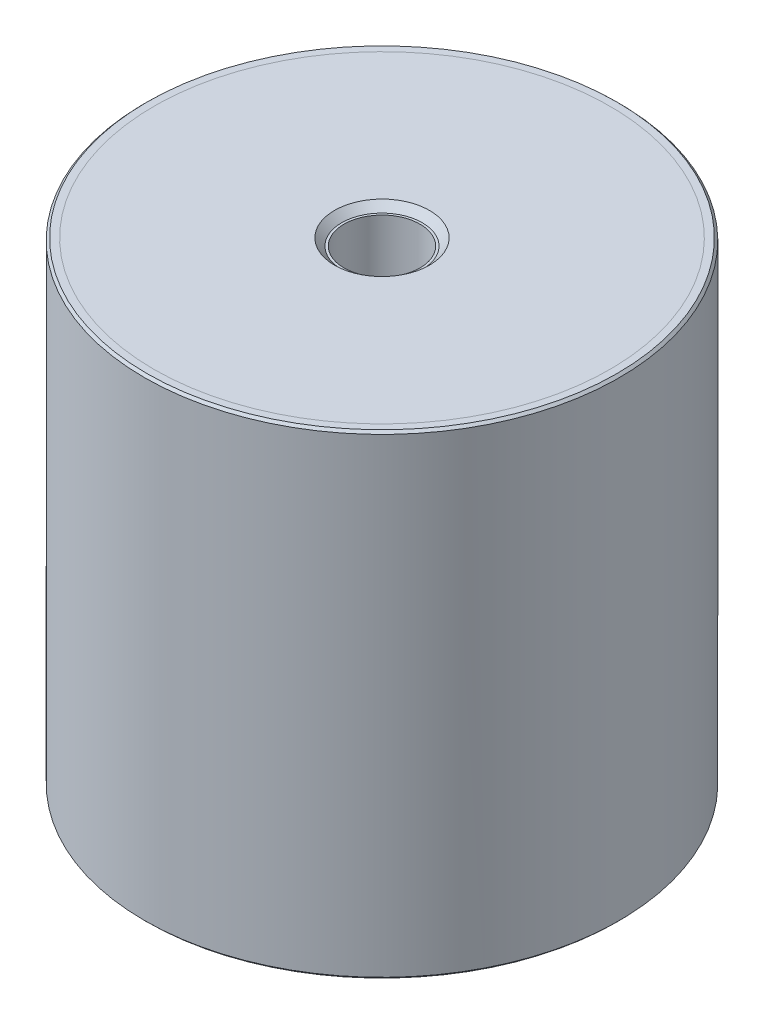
ISO-10303-21;
HEADER;
FILE_DESCRIPTION(('STEP AP214'),'2;1');
FILE_NAME('part.step','',(''),(''),'','','');
FILE_SCHEMA(('AUTOMOTIVE_DESIGN { 1 0 10303 214 1 1 1 1 }'));
ENDSEC;
DATA;
#1=APPLICATION_CONTEXT('core data for automotive mechanical design processes');
#2=APPLICATION_PROTOCOL_DEFINITION('international standard','automotive_design',2000,#1);
#3=PRODUCT_CONTEXT('',#1,'mechanical');
#4=PRODUCT('Part','Part','',(#3));
#5=PRODUCT_RELATED_PRODUCT_CATEGORY('part','',(#4));
#6=PRODUCT_DEFINITION_FORMATION('','',#4);
#7=PRODUCT_DEFINITION_CONTEXT('part definition',#1,'design');
#8=PRODUCT_DEFINITION('design','',#6,#7);
#9=PRODUCT_DEFINITION_SHAPE('','',#8);
#10=(LENGTH_UNIT() NAMED_UNIT(*) SI_UNIT(.MILLI.,.METRE.));
#11=(NAMED_UNIT(*) PLANE_ANGLE_UNIT() SI_UNIT($,.RADIAN.));
#12=(NAMED_UNIT(*) SI_UNIT($,.STERADIAN.) SOLID_ANGLE_UNIT());
#13=UNCERTAINTY_MEASURE_WITH_UNIT(LENGTH_MEASURE(1.E-05),#10,'distance_accuracy_value','');
#14=(GEOMETRIC_REPRESENTATION_CONTEXT(3) GLOBAL_UNCERTAINTY_ASSIGNED_CONTEXT((#13)) GLOBAL_UNIT_ASSIGNED_CONTEXT((#10,
#11,#12)) REPRESENTATION_CONTEXT('',''));
#15=CARTESIAN_POINT('',(0.,0.,0.));
#16=DIRECTION('',(0.,0.,1.));
#17=DIRECTION('',(1.,0.,0.));
#18=AXIS2_PLACEMENT_3D('',#15,#16,#17);
#19=CARTESIAN_POINT('',(0.,-97.,8.));
#20=DIRECTION('',(0.,1.,0.));
#21=DIRECTION('',(0.,0.,1.));
#22=AXIS2_PLACEMENT_3D('',#19,#20,#21);
#23=PLANE('',#22);
#24=CARTESIAN_POINT('',(0.,-97.,0.));
#25=DIRECTION('',(0.,1.,0.));
#26=DIRECTION('',(0.,0.,1.));
#27=AXIS2_PLACEMENT_3D('',#24,#25,#26);
#28=CIRCLE('',#27,8.50000000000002);
#29=CARTESIAN_POINT('',(0.,-97.,8.50000000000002));
#30=VERTEX_POINT('',#29);
#31=EDGE_CURVE('P0_E10',#30,#30,#28,.F.);
#32=ORIENTED_EDGE('',*,*,#31,.T.);
#33=EDGE_LOOP('',(#32));
#34=FACE_BOUND('',#33,.T.);
#35=CARTESIAN_POINT('',(0.,-97.,0.));
#36=DIRECTION('',(0.,1.,0.));
#37=DIRECTION('',(0.,0.,1.));
#38=AXIS2_PLACEMENT_3D('',#35,#36,#37);
#39=CIRCLE('',#38,48.);
#40=CARTESIAN_POINT('',(0.,-97.,48.));
#41=VERTEX_POINT('',#40);
#42=EDGE_CURVE('P0_E25',#41,#41,#39,.T.);
#43=ORIENTED_EDGE('',*,*,#42,.T.);
#44=EDGE_LOOP('',(#43));
#45=FACE_BOUND('',#44,.T.);
#46=ADVANCED_FACE('P0_F14',(#34,#45),#23,.T.);
#47=CARTESIAN_POINT('',(0.,-28.9659571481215,0.));
#48=DIRECTION('',(0.,1.,0.));
#49=DIRECTION('',(0.,0.,1.));
#50=AXIS2_PLACEMENT_3D('',#47,#48,#49);
#51=CYLINDRICAL_SURFACE('',#50,48.);
#52=CARTESIAN_POINT('',(0.,-98.5,0.));
#53=DIRECTION('',(0.,1.,0.));
#54=DIRECTION('',(0.,0.,1.));
#55=AXIS2_PLACEMENT_3D('',#52,#53,#54);
#56=CIRCLE('',#55,48.);
#57=CARTESIAN_POINT('',(0.,-98.5,48.));
#58=VERTEX_POINT('',#57);
#59=EDGE_CURVE('P0_E29',#58,#58,#56,.T.);
#60=ORIENTED_EDGE('',*,*,#59,.T.);
#61=EDGE_LOOP('',(#60));
#62=FACE_BOUND('',#61,.T.);
#63=ORIENTED_EDGE('',*,*,#42,.F.);
#64=EDGE_LOOP('',(#63));
#65=FACE_BOUND('',#64,.T.);
#66=ADVANCED_FACE('P0_F35',(#62,#65),#51,.T.);
#67=CARTESIAN_POINT('',(0.,-98.5,48.));
#68=DIRECTION('',(0.,-1.,0.));
#69=DIRECTION('',(0.,0.,-1.));
#70=AXIS2_PLACEMENT_3D('',#67,#68,#69);
#71=PLANE('',#70);
#72=CARTESIAN_POINT('',(0.,-98.5,0.));
#73=DIRECTION('',(0.,-1.,0.));
#74=DIRECTION('',(0.,0.,-1.));
#75=AXIS2_PLACEMENT_3D('',#72,#73,#74);
#76=CIRCLE('',#75,10.);
#77=CARTESIAN_POINT('',(0.,-98.5,-10.));
#78=VERTEX_POINT('',#77);
#79=EDGE_CURVE('P0_E21',#78,#78,#76,.F.);
#80=ORIENTED_EDGE('',*,*,#79,.T.);
#81=EDGE_LOOP('',(#80));
#82=FACE_BOUND('',#81,.T.);
#83=ORIENTED_EDGE('',*,*,#59,.F.);
#84=EDGE_LOOP('',(#83));
#85=FACE_BOUND('',#84,.T.);
#86=ADVANCED_FACE('P0_F38',(#82,#85),#71,.T.);
#87=CARTESIAN_POINT('',(0.,-98.5,0.));
#88=DIRECTION('',(0.,-1.,0.));
#89=DIRECTION('',(0.,0.,-1.));
#90=AXIS2_PLACEMENT_3D('',#87,#88,#89);
#91=CONICAL_SURFACE('',#90,10.,0.785398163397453);
#92=ORIENTED_EDGE('',*,*,#31,.F.);
#93=EDGE_LOOP('',(#92));
#94=FACE_BOUND('',#93,.T.);
#95=ORIENTED_EDGE('',*,*,#79,.F.);
#96=EDGE_LOOP('',(#95));
#97=FACE_BOUND('',#96,.T.);
#98=ADVANCED_FACE('P0_F16',(#94,#97),#91,.F.);
#99=CLOSED_SHELL('',(#46,#66,#86,#98));
#100=MANIFOLD_SOLID_BREP('P0_B1',#99);
#101=CARTESIAN_POINT('',(0.,1.5,8.));
#102=DIRECTION('',(0.,1.,0.));
#103=DIRECTION('',(0.,0.,1.));
#104=AXIS2_PLACEMENT_3D('',#101,#102,#103);
#105=PLANE('',#104);
#106=CARTESIAN_POINT('',(0.,1.5,0.));
#107=DIRECTION('',(0.,1.,0.));
#108=DIRECTION('',(0.,0.,1.));
#109=AXIS2_PLACEMENT_3D('',#106,#107,#108);
#110=CIRCLE('',#109,10.);
#111=CARTESIAN_POINT('',(0.,1.5,10.));
#112=VERTEX_POINT('',#111);
#113=EDGE_CURVE('P1_E10',#112,#112,#110,.F.);
#114=ORIENTED_EDGE('',*,*,#113,.T.);
#115=EDGE_LOOP('',(#114));
#116=FACE_BOUND('',#115,.T.);
#117=CARTESIAN_POINT('',(0.,1.5,0.));
#118=DIRECTION('',(0.,1.,0.));
#119=DIRECTION('',(0.,0.,1.));
#120=AXIS2_PLACEMENT_3D('',#117,#118,#119);
#121=CIRCLE('',#120,48.);
#122=CARTESIAN_POINT('',(0.,1.5,48.));
#123=VERTEX_POINT('',#122);
#124=EDGE_CURVE('P1_E25',#123,#123,#121,.T.);
#125=ORIENTED_EDGE('',*,*,#124,.T.);
#126=EDGE_LOOP('',(#125));
#127=FACE_BOUND('',#126,.T.);
#128=ADVANCED_FACE('P1_F14',(#116,#127),#105,.T.);
#129=CARTESIAN_POINT('',(0.,69.5340428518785,0.));
#130=DIRECTION('',(0.,1.,0.));
#131=DIRECTION('',(0.,0.,1.));
#132=AXIS2_PLACEMENT_3D('',#129,#130,#131);
#133=CYLINDRICAL_SURFACE('',#132,48.);
#134=CARTESIAN_POINT('',(0.,0.,0.));
#135=DIRECTION('',(0.,1.,0.));
#136=DIRECTION('',(0.,0.,1.));
#137=AXIS2_PLACEMENT_3D('',#134,#135,#136);
#138=CIRCLE('',#137,48.);
#139=CARTESIAN_POINT('',(0.,0.,48.));
#140=VERTEX_POINT('',#139);
#141=EDGE_CURVE('P1_E29',#140,#140,#138,.T.);
#142=ORIENTED_EDGE('',*,*,#141,.T.);
#143=EDGE_LOOP('',(#142));
#144=FACE_BOUND('',#143,.T.);
#145=ORIENTED_EDGE('',*,*,#124,.F.);
#146=EDGE_LOOP('',(#145));
#147=FACE_BOUND('',#146,.T.);
#148=ADVANCED_FACE('P1_F35',(#144,#147),#133,.T.);
#149=CARTESIAN_POINT('',(0.,0.,48.));
#150=DIRECTION('',(0.,-1.,0.));
#151=DIRECTION('',(0.,0.,-1.));
#152=AXIS2_PLACEMENT_3D('',#149,#150,#151);
#153=PLANE('',#152);
#154=CARTESIAN_POINT('',(0.,0.,0.));
#155=DIRECTION('',(0.,-1.,0.));
#156=DIRECTION('',(0.,0.,-1.));
#157=AXIS2_PLACEMENT_3D('',#154,#155,#156);
#158=CIRCLE('',#157,8.50000000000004);
#159=CARTESIAN_POINT('',(0.,0.,-8.50000000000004));
#160=VERTEX_POINT('',#159);
#161=EDGE_CURVE('P1_E21',#160,#160,#158,.F.);
#162=ORIENTED_EDGE('',*,*,#161,.T.);
#163=EDGE_LOOP('',(#162));
#164=FACE_BOUND('',#163,.T.);
#165=ORIENTED_EDGE('',*,*,#141,.F.);
#166=EDGE_LOOP('',(#165));
#167=FACE_BOUND('',#166,.T.);
#168=ADVANCED_FACE('P1_F38',(#164,#167),#153,.T.);
#169=CARTESIAN_POINT('',(0.,-0.500000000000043,0.));
#170=DIRECTION('',(0.,1.,0.));
#171=DIRECTION('',(0.,0.,1.));
#172=AXIS2_PLACEMENT_3D('',#169,#170,#171);
#173=CONICAL_SURFACE('',#172,8.,0.785398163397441);
#174=ORIENTED_EDGE('',*,*,#113,.F.);
#175=EDGE_LOOP('',(#174));
#176=FACE_BOUND('',#175,.T.);
#177=ORIENTED_EDGE('',*,*,#161,.F.);
#178=EDGE_LOOP('',(#177));
#179=FACE_BOUND('',#178,.T.);
#180=ADVANCED_FACE('P1_F16',(#176,#179),#173,.F.);
#181=CLOSED_SHELL('',(#128,#148,#168,#180));
#182=MANIFOLD_SOLID_BREP('P1_B1',#181);
#183=CARTESIAN_POINT('',(0.,0.,0.));
#184=DIRECTION('',(0.,1.,0.));
#185=DIRECTION('',(0.,0.,1.));
#186=AXIS2_PLACEMENT_3D('',#183,#184,#185);
#187=PLANE('',#186);
#188=CARTESIAN_POINT('',(0.,0.,0.));
#189=DIRECTION('',(0.,1.,0.));
#190=DIRECTION('',(0.,0.,1.));
#191=AXIS2_PLACEMENT_3D('',#188,#189,#190);
#192=CIRCLE('',#191,8.);
#193=CARTESIAN_POINT('',(0.,0.,8.));
#194=VERTEX_POINT('',#193);
#195=EDGE_CURVE('P2_E46',#194,#194,#192,.T.);
#196=ORIENTED_EDGE('',*,*,#195,.F.);
#197=EDGE_LOOP('',(#196));
#198=FACE_BOUND('',#197,.T.);
#199=CARTESIAN_POINT('',(0.,0.,0.));
#200=DIRECTION('',(0.,1.,0.));
#201=DIRECTION('',(0.,0.,1.));
#202=AXIS2_PLACEMENT_3D('',#199,#200,#201);
#203=CIRCLE('',#202,48.);
#204=CARTESIAN_POINT('',(0.,0.,48.));
#205=VERTEX_POINT('',#204);
#206=EDGE_CURVE('P2_E33',#205,#205,#203,.T.);
#207=ORIENTED_EDGE('',*,*,#206,.T.);
#208=EDGE_LOOP('',(#207));
#209=FACE_BOUND('',#208,.T.);
#210=ADVANCED_FACE('P2_F13',(#198,#209),#187,.T.);
#211=CARTESIAN_POINT('',(0.,65.5134936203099,0.));
#212=DIRECTION('',(0.,1.,0.));
#213=DIRECTION('',(0.,0.,1.));
#214=AXIS2_PLACEMENT_3D('',#211,#212,#213);
#215=CYLINDRICAL_SURFACE('',#214,48.);
#216=CARTESIAN_POINT('',(0.,1.49999999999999,0.));
#217=DIRECTION('',(0.,1.,0.));
#218=DIRECTION('',(0.,0.,1.));
#219=AXIS2_PLACEMENT_3D('',#216,#217,#218);
#220=CIRCLE('',#219,48.);
#221=CARTESIAN_POINT('',(0.,1.49999999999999,48.));
#222=VERTEX_POINT('',#221);
#223=EDGE_CURVE('P2_E36',#222,#222,#220,.T.);
#224=ORIENTED_EDGE('',*,*,#223,.T.);
#225=EDGE_LOOP('',(#224));
#226=FACE_BOUND('',#225,.T.);
#227=ORIENTED_EDGE('',*,*,#206,.F.);
#228=EDGE_LOOP('',(#227));
#229=FACE_BOUND('',#228,.T.);
#230=ADVANCED_FACE('P2_F92',(#226,#229),#215,.F.);
#231=CARTESIAN_POINT('',(0.,1.49999999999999,48.));
#232=DIRECTION('',(0.,1.,0.));
#233=DIRECTION('',(0.,0.,1.));
#234=AXIS2_PLACEMENT_3D('',#231,#232,#233);
#235=PLANE('',#234);
#236=CARTESIAN_POINT('',(0.,1.49999999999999,0.));
#237=DIRECTION('',(0.,1.,0.));
#238=DIRECTION('',(0.,0.,1.));
#239=AXIS2_PLACEMENT_3D('',#236,#237,#238);
#240=CIRCLE('',#239,49.5);
#241=CARTESIAN_POINT('',(0.,1.49999999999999,49.5));
#242=VERTEX_POINT('',#241);
#243=EDGE_CURVE('P2_E9',#242,#242,#240,.T.);
#244=ORIENTED_EDGE('',*,*,#243,.T.);
#245=EDGE_LOOP('',(#244));
#246=FACE_BOUND('',#245,.T.);
#247=ORIENTED_EDGE('',*,*,#223,.F.);
#248=EDGE_LOOP('',(#247));
#249=FACE_BOUND('',#248,.T.);
#250=ADVANCED_FACE('P2_F88',(#246,#249),#235,.T.);
#251=CARTESIAN_POINT('',(0.,65.5134936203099,0.));
#252=DIRECTION('',(0.,1.,0.));
#253=DIRECTION('',(0.,0.,1.));
#254=AXIS2_PLACEMENT_3D('',#251,#252,#253);
#255=CYLINDRICAL_SURFACE('',#254,50.);
#256=CARTESIAN_POINT('',(0.,-98.,0.));
#257=DIRECTION('',(0.,-1.,0.));
#258=DIRECTION('',(0.,0.,-1.));
#259=AXIS2_PLACEMENT_3D('',#256,#257,#258);
#260=CIRCLE('',#259,50.);
#261=CARTESIAN_POINT('',(0.,-98.,-50.));
#262=VERTEX_POINT('',#261);
#263=EDGE_CURVE('P2_E24',#262,#262,#260,.F.);
#264=ORIENTED_EDGE('',*,*,#263,.T.);
#265=EDGE_LOOP('',(#264));
#266=FACE_BOUND('',#265,.T.);
#267=CARTESIAN_POINT('',(0.,0.999999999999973,0.));
#268=DIRECTION('',(0.,1.,0.));
#269=DIRECTION('',(0.,0.,1.));
#270=AXIS2_PLACEMENT_3D('',#267,#268,#269);
#271=CIRCLE('',#270,50.);
#272=CARTESIAN_POINT('',(0.,0.999999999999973,50.));
#273=VERTEX_POINT('',#272);
#274=EDGE_CURVE('P2_E28',#273,#273,#271,.F.);
#275=ORIENTED_EDGE('',*,*,#274,.T.);
#276=EDGE_LOOP('',(#275));
#277=FACE_BOUND('',#276,.T.);
#278=ADVANCED_FACE('P2_F82',(#266,#277),#255,.T.);
#279=CARTESIAN_POINT('',(0.,-98.5,50.));
#280=DIRECTION('',(0.,-1.,0.));
#281=DIRECTION('',(0.,0.,-1.));
#282=AXIS2_PLACEMENT_3D('',#279,#280,#281);
#283=PLANE('',#282);
#284=CARTESIAN_POINT('',(0.,-98.5,0.));
#285=DIRECTION('',(0.,-1.,0.));
#286=DIRECTION('',(0.,0.,-1.));
#287=AXIS2_PLACEMENT_3D('',#284,#285,#286);
#288=CIRCLE('',#287,49.5);
#289=CARTESIAN_POINT('',(0.,-98.5,-49.5));
#290=VERTEX_POINT('',#289);
#291=EDGE_CURVE('P2_E20',#290,#290,#288,.T.);
#292=ORIENTED_EDGE('',*,*,#291,.T.);
#293=EDGE_LOOP('',(#292));
#294=FACE_BOUND('',#293,.T.);
#295=CARTESIAN_POINT('',(0.,-98.5,0.));
#296=DIRECTION('',(0.,1.,0.));
#297=DIRECTION('',(0.,0.,1.));
#298=AXIS2_PLACEMENT_3D('',#295,#296,#297);
#299=CIRCLE('',#298,48.);
#300=CARTESIAN_POINT('',(0.,-98.5,48.));
#301=VERTEX_POINT('',#300);
#302=EDGE_CURVE('P2_E39',#301,#301,#299,.T.);
#303=ORIENTED_EDGE('',*,*,#302,.T.);
#304=EDGE_LOOP('',(#303));
#305=FACE_BOUND('',#304,.T.);
#306=ADVANCED_FACE('P2_F77',(#294,#305),#283,.T.);
#307=CARTESIAN_POINT('',(0.,65.5134936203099,0.));
#308=DIRECTION('',(0.,1.,0.));
#309=DIRECTION('',(0.,0.,1.));
#310=AXIS2_PLACEMENT_3D('',#307,#308,#309);
#311=CYLINDRICAL_SURFACE('',#310,48.);
#312=CARTESIAN_POINT('',(0.,-97.,0.));
#313=DIRECTION('',(0.,1.,0.));
#314=DIRECTION('',(0.,0.,1.));
#315=AXIS2_PLACEMENT_3D('',#312,#313,#314);
#316=CIRCLE('',#315,48.);
#317=CARTESIAN_POINT('',(0.,-97.,48.));
#318=VERTEX_POINT('',#317);
#319=EDGE_CURVE('P2_E42',#318,#318,#316,.T.);
#320=ORIENTED_EDGE('',*,*,#319,.T.);
#321=EDGE_LOOP('',(#320));
#322=FACE_BOUND('',#321,.T.);
#323=ORIENTED_EDGE('',*,*,#302,.F.);
#324=EDGE_LOOP('',(#323));
#325=FACE_BOUND('',#324,.T.);
#326=ADVANCED_FACE('P2_F71',(#322,#325),#311,.F.);
#327=CARTESIAN_POINT('',(0.,-97.,48.));
#328=DIRECTION('',(0.,-1.,0.));
#329=DIRECTION('',(0.,0.,-1.));
#330=AXIS2_PLACEMENT_3D('',#327,#328,#329);
#331=PLANE('',#330);
#332=CARTESIAN_POINT('',(0.,-97.,0.));
#333=DIRECTION('',(0.,-1.,0.));
#334=DIRECTION('',(0.,0.,-1.));
#335=AXIS2_PLACEMENT_3D('',#332,#333,#334);
#336=CIRCLE('',#335,8.);
#337=CARTESIAN_POINT('',(0.,-97.,-8.));
#338=VERTEX_POINT('',#337);
#339=EDGE_CURVE('P2_E52',#338,#338,#336,.T.);
#340=ORIENTED_EDGE('',*,*,#339,.F.);
#341=EDGE_LOOP('',(#340));
#342=FACE_BOUND('',#341,.T.);
#343=ORIENTED_EDGE('',*,*,#319,.F.);
#344=EDGE_LOOP('',(#343));
#345=FACE_BOUND('',#344,.T.);
#346=ADVANCED_FACE('P2_F67',(#342,#345),#331,.T.);
#347=CARTESIAN_POINT('',(0.,-98.,0.));
#348=DIRECTION('',(0.,1.,0.));
#349=DIRECTION('',(0.,0.,1.));
#350=AXIS2_PLACEMENT_3D('',#347,#348,#349);
#351=CONICAL_SURFACE('',#350,50.,0.785398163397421);
#352=ORIENTED_EDGE('',*,*,#291,.F.);
#353=EDGE_LOOP('',(#352));
#354=FACE_BOUND('',#353,.T.);
#355=ORIENTED_EDGE('',*,*,#263,.F.);
#356=EDGE_LOOP('',(#355));
#357=FACE_BOUND('',#356,.T.);
#358=ADVANCED_FACE('P2_F70',(#354,#357),#351,.T.);
#359=CARTESIAN_POINT('',(0.,1.49999999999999,0.));
#360=DIRECTION('',(0.,-1.,0.));
#361=DIRECTION('',(0.,0.,-1.));
#362=AXIS2_PLACEMENT_3D('',#359,#360,#361);
#363=CONICAL_SURFACE('',#362,49.5,0.785398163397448);
#364=ORIENTED_EDGE('',*,*,#274,.F.);
#365=EDGE_LOOP('',(#364));
#366=FACE_BOUND('',#365,.T.);
#367=ORIENTED_EDGE('',*,*,#243,.F.);
#368=EDGE_LOOP('',(#367));
#369=FACE_BOUND('',#368,.T.);
#370=ADVANCED_FACE('P2_F15',(#366,#369),#363,.T.);
#371=CARTESIAN_POINT('',(0.,-14.5,0.));
#372=DIRECTION('',(0.,1.,0.));
#373=DIRECTION('',(0.,0.,1.));
#374=AXIS2_PLACEMENT_3D('',#371,#372,#373);
#375=CYLINDRICAL_SURFACE('',#374,8.);
#376=CARTESIAN_POINT('',(0.,-14.5,0.));
#377=DIRECTION('',(0.,1.,0.));
#378=DIRECTION('',(0.,0.,1.));
#379=AXIS2_PLACEMENT_3D('',#376,#377,#378);
#380=CIRCLE('',#379,8.);
#381=CARTESIAN_POINT('',(0.,-14.5,8.));
#382=VERTEX_POINT('',#381);
#383=EDGE_CURVE('P2_E45',#382,#382,#380,.T.);
#384=CARTESIAN_POINT('',(0.,-14.5,8.));
#385=CARTESIAN_POINT('',(0.,-14.3489583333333,8.));
#386=CARTESIAN_POINT('',(0.,-14.1979166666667,8.));
#387=CARTESIAN_POINT('',(0.,-13.8958333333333,8.));
#388=CARTESIAN_POINT('',(0.,-13.7447916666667,8.));
#389=CARTESIAN_POINT('',(0.,-13.4427083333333,8.));
#390=CARTESIAN_POINT('',(0.,-13.2916666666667,8.));
#391=CARTESIAN_POINT('',(0.,-12.9895833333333,8.));
#392=CARTESIAN_POINT('',(0.,-12.8385416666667,8.));
#393=CARTESIAN_POINT('',(0.,-12.5364583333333,8.));
#394=CARTESIAN_POINT('',(0.,-12.3854166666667,8.));
#395=CARTESIAN_POINT('',(0.,-12.0833333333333,8.));
#396=CARTESIAN_POINT('',(0.,-11.9322916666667,8.));
#397=CARTESIAN_POINT('',(0.,-11.6302083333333,8.));
#398=CARTESIAN_POINT('',(0.,-11.4791666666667,8.));
#399=CARTESIAN_POINT('',(0.,-11.1770833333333,8.));
#400=CARTESIAN_POINT('',(0.,-11.0260416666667,8.));
#401=CARTESIAN_POINT('',(0.,-10.7239583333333,8.));
#402=CARTESIAN_POINT('',(0.,-10.5729166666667,8.));
#403=CARTESIAN_POINT('',(0.,-10.2708333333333,8.));
#404=CARTESIAN_POINT('',(0.,-10.1197916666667,8.));
#405=CARTESIAN_POINT('',(0.,-9.81770833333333,8.));
#406=CARTESIAN_POINT('',(0.,-9.66666666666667,8.));
#407=CARTESIAN_POINT('',(0.,-9.36458333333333,8.));
#408=CARTESIAN_POINT('',(0.,-9.21354166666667,8.));
#409=CARTESIAN_POINT('',(0.,-8.91145833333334,8.));
#410=CARTESIAN_POINT('',(0.,-8.76041666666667,8.));
#411=CARTESIAN_POINT('',(0.,-8.45833333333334,8.));
#412=CARTESIAN_POINT('',(0.,-8.30729166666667,8.));
#413=CARTESIAN_POINT('',(0.,-8.00520833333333,8.));
#414=CARTESIAN_POINT('',(0.,-7.85416666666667,8.));
#415=CARTESIAN_POINT('',(0.,-7.55208333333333,8.));
#416=CARTESIAN_POINT('',(0.,-7.40104166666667,8.));
#417=CARTESIAN_POINT('',(0.,-7.09895833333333,8.));
#418=CARTESIAN_POINT('',(0.,-6.94791666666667,8.));
#419=CARTESIAN_POINT('',(0.,-6.64583333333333,8.));
#420=CARTESIAN_POINT('',(0.,-6.49479166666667,8.));
#421=CARTESIAN_POINT('',(0.,-6.19270833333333,8.));
#422=CARTESIAN_POINT('',(0.,-6.04166666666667,8.));
#423=CARTESIAN_POINT('',(0.,-5.73958333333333,8.));
#424=CARTESIAN_POINT('',(0.,-5.58854166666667,8.));
#425=CARTESIAN_POINT('',(0.,-5.28645833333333,8.));
#426=CARTESIAN_POINT('',(0.,-5.13541666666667,8.));
#427=CARTESIAN_POINT('',(0.,-4.83333333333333,8.));
#428=CARTESIAN_POINT('',(0.,-4.68229166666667,8.));
#429=CARTESIAN_POINT('',(0.,-4.38020833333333,8.));
#430=CARTESIAN_POINT('',(0.,-4.22916666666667,8.));
#431=CARTESIAN_POINT('',(0.,-3.92708333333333,8.));
#432=CARTESIAN_POINT('',(0.,-3.77604166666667,8.));
#433=CARTESIAN_POINT('',(0.,-3.47395833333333,8.));
#434=CARTESIAN_POINT('',(0.,-3.32291666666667,8.));
#435=CARTESIAN_POINT('',(0.,-3.02083333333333,8.));
#436=CARTESIAN_POINT('',(0.,-2.86979166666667,8.));
#437=CARTESIAN_POINT('',(0.,-2.56770833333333,8.));
#438=CARTESIAN_POINT('',(0.,-2.41666666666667,8.));
#439=CARTESIAN_POINT('',(0.,-2.11458333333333,8.));
#440=CARTESIAN_POINT('',(0.,-1.96354166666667,8.));
#441=CARTESIAN_POINT('',(0.,-1.66145833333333,8.));
#442=CARTESIAN_POINT('',(0.,-1.51041666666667,8.));
#443=CARTESIAN_POINT('',(0.,-1.20833333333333,8.));
#444=CARTESIAN_POINT('',(0.,-1.05729166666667,8.));
#445=CARTESIAN_POINT('',(0.,-0.755208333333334,8.));
#446=CARTESIAN_POINT('',(0.,-0.604166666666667,8.));
#447=CARTESIAN_POINT('',(0.,-0.302083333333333,8.));
#448=CARTESIAN_POINT('',(0.,-0.151041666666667,8.));
#449=CARTESIAN_POINT('',(0.,0.,8.));
#450=B_SPLINE_CURVE_WITH_KNOTS('',3,(#384,#385,#386,#387,#388,#389,#390,#391,#392,#393,#394,
#395,#396,#397,#398,#399,#400,#401,#402,#403,#404,#405,#406,#407,#408,#409,#410,#411,#412,#413,
#414,#415,#416,#417,#418,#419,#420,#421,#422,#423,#424,#425,#426,#427,#428,#429,#430,#431,#432,
#433,#434,#435,#436,#437,#438,#439,#440,#441,#442,#443,#444,#445,#446,#447,#448,#449),
.UNSPECIFIED.,.F.,.F.,(4,2,2,2,2,2,2,2,2,2,2,2,2,2,2,2,2,2,2,2,2,2,2,2,2,2,2,2,2,2,2,2,4),(0.,
0.453124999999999,0.906249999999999,1.359375,1.8125,2.265625,2.71875,3.171875,3.625,4.078125,
4.53125,4.984375,5.4375,5.890625,6.34375,6.796875,7.25,7.703125,8.15625,8.609375,9.0625,
9.515625,9.96875,10.421875,10.875,11.328125,11.78125,12.234375,12.6875,13.140625,13.59375,
14.046875,14.5),.UNSPECIFIED.);
#451=EDGE_CURVE('P2_BSEAM108',#382,#194,#450,.T.);
#452=ORIENTED_EDGE('',*,*,#383,.F.);
#453=ORIENTED_EDGE('',*,*,#195,.T.);
#454=ORIENTED_EDGE('',*,*,#451,.T.);
#455=ORIENTED_EDGE('',*,*,#451,.F.);
#456=EDGE_LOOP('',(#452,#454,#453,#455));
#457=FACE_BOUND('',#456,.T.);
#458=ADVANCED_FACE('P2_F108',(#457),#375,.F.);
#459=CARTESIAN_POINT('',(0.,-14.5,0.));
#460=DIRECTION('',(0.,1.,0.));
#461=DIRECTION('',(0.,0.,1.));
#462=AXIS2_PLACEMENT_3D('',#459,#460,#461);
#463=PLANE('',#462);
#464=ORIENTED_EDGE('',*,*,#383,.T.);
#465=EDGE_LOOP('',(#464));
#466=FACE_BOUND('',#465,.T.);
#467=ADVANCED_FACE('P2_F63',(#466),#463,.T.);
#468=CARTESIAN_POINT('',(0.,-82.5,0.));
#469=DIRECTION('',(0.,-1.,0.));
#470=DIRECTION('',(0.,0.,-1.));
#471=AXIS2_PLACEMENT_3D('',#468,#469,#470);
#472=CYLINDRICAL_SURFACE('',#471,8.);
#473=CARTESIAN_POINT('',(0.,-82.5,0.));
#474=DIRECTION('',(0.,-1.,0.));
#475=DIRECTION('',(0.,0.,-1.));
#476=AXIS2_PLACEMENT_3D('',#473,#474,#475);
#477=CIRCLE('',#476,8.);
#478=CARTESIAN_POINT('',(0.,-82.5,-8.));
#479=VERTEX_POINT('',#478);
#480=EDGE_CURVE('P2_E49',#479,#479,#477,.T.);
#481=CARTESIAN_POINT('',(0.,-82.5,-8.));
#482=CARTESIAN_POINT('',(0.,-82.6510416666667,-8.));
#483=CARTESIAN_POINT('',(0.,-82.8020833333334,-8.));
#484=CARTESIAN_POINT('',(0.,-83.1041666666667,-8.));
#485=CARTESIAN_POINT('',(0.,-83.2552083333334,-8.));
#486=CARTESIAN_POINT('',(0.,-83.5572916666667,-8.));
#487=CARTESIAN_POINT('',(0.,-83.7083333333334,-8.));
#488=CARTESIAN_POINT('',(0.,-84.0104166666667,-8.));
#489=CARTESIAN_POINT('',(0.,-84.1614583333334,-8.));
#490=CARTESIAN_POINT('',(0.,-84.4635416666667,-8.));
#491=CARTESIAN_POINT('',(0.,-84.6145833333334,-8.));
#492=CARTESIAN_POINT('',(0.,-84.9166666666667,-8.));
#493=CARTESIAN_POINT('',(0.,-85.0677083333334,-8.));
#494=CARTESIAN_POINT('',(0.,-85.3697916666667,-8.));
#495=CARTESIAN_POINT('',(0.,-85.5208333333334,-8.));
#496=CARTESIAN_POINT('',(0.,-85.8229166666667,-8.));
#497=CARTESIAN_POINT('',(0.,-85.9739583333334,-8.));
#498=CARTESIAN_POINT('',(0.,-86.2760416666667,-8.));
#499=CARTESIAN_POINT('',(0.,-86.4270833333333,-8.));
#500=CARTESIAN_POINT('',(0.,-86.7291666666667,-8.));
#501=CARTESIAN_POINT('',(0.,-86.8802083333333,-8.));
#502=CARTESIAN_POINT('',(0.,-87.1822916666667,-8.));
#503=CARTESIAN_POINT('',(0.,-87.3333333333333,-8.));
#504=CARTESIAN_POINT('',(0.,-87.6354166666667,-8.));
#505=CARTESIAN_POINT('',(0.,-87.7864583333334,-8.));
#506=CARTESIAN_POINT('',(0.,-88.0885416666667,-8.));
#507=CARTESIAN_POINT('',(0.,-88.2395833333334,-8.));
#508=CARTESIAN_POINT('',(0.,-88.5416666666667,-8.));
#509=CARTESIAN_POINT('',(0.,-88.6927083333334,-8.));
#510=CARTESIAN_POINT('',(0.,-88.9947916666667,-8.));
#511=CARTESIAN_POINT('',(0.,-89.1458333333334,-8.));
#512=CARTESIAN_POINT('',(0.,-89.4479166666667,-8.));
#513=CARTESIAN_POINT('',(0.,-89.5989583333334,-8.));
#514=CARTESIAN_POINT('',(0.,-89.9010416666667,-8.));
#515=CARTESIAN_POINT('',(0.,-90.0520833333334,-8.));
#516=CARTESIAN_POINT('',(0.,-90.3541666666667,-8.));
#517=CARTESIAN_POINT('',(0.,-90.5052083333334,-8.));
#518=CARTESIAN_POINT('',(0.,-90.8072916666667,-8.));
#519=CARTESIAN_POINT('',(0.,-90.9583333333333,-8.));
#520=CARTESIAN_POINT('',(0.,-91.2604166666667,-8.));
#521=CARTESIAN_POINT('',(0.,-91.4114583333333,-8.));
#522=CARTESIAN_POINT('',(0.,-91.7135416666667,-8.));
#523=CARTESIAN_POINT('',(0.,-91.8645833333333,-8.));
#524=CARTESIAN_POINT('',(0.,-92.1666666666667,-8.));
#525=CARTESIAN_POINT('',(0.,-92.3177083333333,-8.));
#526=CARTESIAN_POINT('',(0.,-92.6197916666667,-8.));
#527=CARTESIAN_POINT('',(0.,-92.7708333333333,-8.));
#528=CARTESIAN_POINT('',(0.,-93.0729166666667,-8.));
#529=CARTESIAN_POINT('',(0.,-93.2239583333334,-8.));
#530=CARTESIAN_POINT('',(0.,-93.5260416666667,-8.));
#531=CARTESIAN_POINT('',(0.,-93.6770833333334,-8.));
#532=CARTESIAN_POINT('',(0.,-93.9791666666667,-8.));
#533=CARTESIAN_POINT('',(0.,-94.1302083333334,-8.));
#534=CARTESIAN_POINT('',(0.,-94.4322916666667,-8.));
#535=CARTESIAN_POINT('',(0.,-94.5833333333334,-8.));
#536=CARTESIAN_POINT('',(0.,-94.8854166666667,-8.));
#537=CARTESIAN_POINT('',(0.,-95.0364583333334,-8.));
#538=CARTESIAN_POINT('',(0.,-95.3385416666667,-8.));
#539=CARTESIAN_POINT('',(0.,-95.4895833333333,-8.));
#540=CARTESIAN_POINT('',(0.,-95.7916666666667,-8.));
#541=CARTESIAN_POINT('',(0.,-95.9427083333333,-8.));
#542=CARTESIAN_POINT('',(0.,-96.2447916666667,-8.));
#543=CARTESIAN_POINT('',(0.,-96.3958333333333,-8.));
#544=CARTESIAN_POINT('',(0.,-96.6979166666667,-8.));
#545=CARTESIAN_POINT('',(0.,-96.8489583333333,-8.));
#546=CARTESIAN_POINT('',(0.,-97.,-8.));
#547=B_SPLINE_CURVE_WITH_KNOTS('',3,(#481,#482,#483,#484,#485,#486,#487,#488,#489,#490,#491,
#492,#493,#494,#495,#496,#497,#498,#499,#500,#501,#502,#503,#504,#505,#506,#507,#508,#509,#510,
#511,#512,#513,#514,#515,#516,#517,#518,#519,#520,#521,#522,#523,#524,#525,#526,#527,#528,#529,
#530,#531,#532,#533,#534,#535,#536,#537,#538,#539,#540,#541,#542,#543,#544,#545,#546),
.UNSPECIFIED.,.F.,.F.,(4,2,2,2,2,2,2,2,2,2,2,2,2,2,2,2,2,2,2,2,2,2,2,2,2,2,2,2,2,2,2,2,4),(0.,
0.453124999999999,0.906249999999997,1.359375,1.81249999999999,2.26562499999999,2.71874999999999,
3.17187499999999,3.62499999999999,4.07812499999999,4.53124999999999,4.98437499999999,5.4375,
5.890625,6.34375,6.79687499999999,7.24999999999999,7.70312499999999,8.15624999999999,
8.60937499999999,9.06249999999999,9.51562499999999,9.96874999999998,10.421875,10.875,11.328125,
11.78125,12.234375,12.6875,13.140625,13.59375,14.046875,14.5),.UNSPECIFIED.);
#548=EDGE_CURVE('P2_BSEAM60',#479,#338,#547,.T.);
#549=ORIENTED_EDGE('',*,*,#480,.F.);
#550=ORIENTED_EDGE('',*,*,#339,.T.);
#551=ORIENTED_EDGE('',*,*,#548,.T.);
#552=ORIENTED_EDGE('',*,*,#548,.F.);
#553=EDGE_LOOP('',(#549,#551,#550,#552));
#554=FACE_BOUND('',#553,.T.);
#555=ADVANCED_FACE('P2_F60',(#554),#472,.F.);
#556=CARTESIAN_POINT('',(0.,-82.5,0.));
#557=DIRECTION('',(0.,-1.,0.));
#558=DIRECTION('',(0.,0.,-1.));
#559=AXIS2_PLACEMENT_3D('',#556,#557,#558);
#560=PLANE('',#559);
#561=ORIENTED_EDGE('',*,*,#480,.T.);
#562=EDGE_LOOP('',(#561));
#563=FACE_BOUND('',#562,.T.);
#564=ADVANCED_FACE('P2_F58',(#563),#560,.T.);
#565=CLOSED_SHELL('',(#210,#230,#250,#278,#306,#326,#346,#358,#370,#458,#467,#555,#564));
#566=MANIFOLD_SOLID_BREP('P2_B1',#565);
#567=ADVANCED_BREP_SHAPE_REPRESENTATION('',(#18,#100,#182,#566),#14);
#568=SHAPE_DEFINITION_REPRESENTATION(#9,#567);
ENDSEC;
END-ISO-10303-21;
